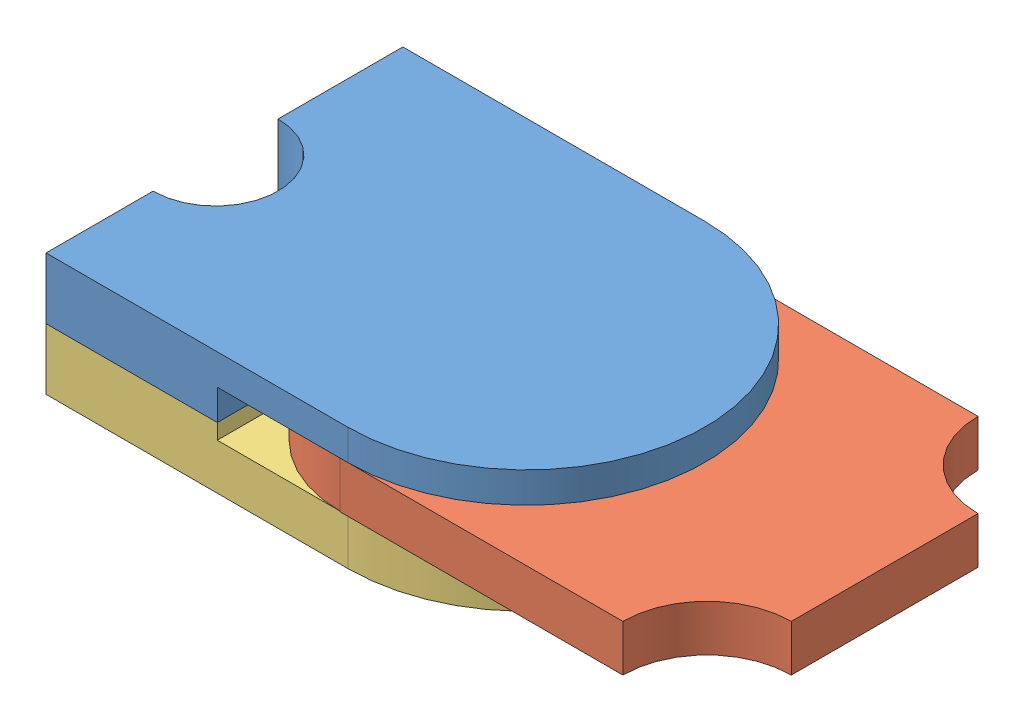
SolidWorks assembly HSassembly.SLDASM, configuration Default (file format 3684). Lengths in mm.
Overall size (137.13 25.4 74.02).
3 component instances, 3 part files, 6 mates.
Components (placement in the parent):
- HSpart1-1: HSpart1.SLDPRT [Default] at (-67.7264 6.05 42.3471) size (99.65 12.7 74.02)
- HSpart2-1: HSpart2.SLDPRT [Default] at (18.6084 2.748 5.5171) size (101.6 9.65 73.66)
- HSpart1b-1: HSpart1b.SLDPRT [Default] at (-67.7264 6.05 42.3471) size (99.65 12.7 74.02)
Mates (geometry in assembly coordinates):
- Coincident1: coincident anti-aligned: plane of ? through (-32.1916 -0.3 -43.0554) normal (1 0 0); plane of HSpart2-1 through (-32.1916 12.4 16.9471) normal (-1 0 0)
- Coincident2: coincident anti-aligned: plane of ? through (-32.1916 12.4 59.4444) normal (0 -1 0); plane of HSpart2-1 through (-6.7916 12.4 -5.9129) normal (0 1 0)
- Coincident3: coincident aligned: plane of ? through (-67.7264 18.75 42.3471) normal (0 0 1); plane of HSpart2-1 through (-6.7916 12.4 42.3471) normal (0 0 1)
- Coincident4: coincident anti-aligned: plane of ? through (-79.8217 6.05 57.1581) normal (0 -1 0); plane of ? through (-79.8217 6.05 57.1581) normal (0 1 0)
- Coincident5: coincident aligned: plane of ? through (-67.7264 18.75 42.3471) normal (0 0 1); plane of ? through (-67.7264 18.75 42.3471) normal (0 0 1)
- Coincident6: coincident aligned: plane of ? through (-67.7264 18.75 42.3471) normal (-1 0 0); plane of ? through (-67.7264 18.75 42.3471) normal (-1 0 0)
